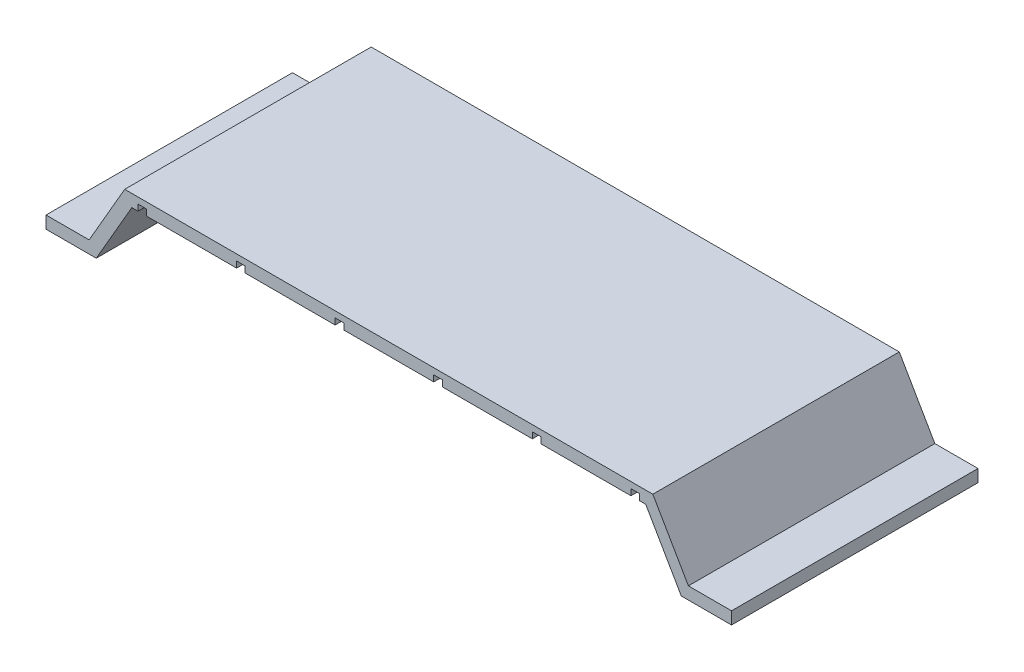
from build123d import *

# Parameters (mm, degrees)
BOSS_EXTRUDE1_DEPTH = 25.4


with BuildPart() as part:
    # Sketch1 → Boss-Extrude1 (new, symmetric)
    with BuildSketch(Plane.XY):
        Polygon((9.271, 0), (-9.271, 0), (-9.271, 1.27), (-11.049, 1.27), (-11.049, 0), (-29.591, 0), (-29.591, 1.27), (-31.369, 1.27), (-31.369, 0), (-49.911, 0), (-49.911, 1.27), (-51.689, 1.27), (-51.689, 0), (-52.959, 0), (-60.291348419, -12.7), (-70.647818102, -12.7), (-70.647818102, -10.16), (-61.757818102, -10.16), (-54.425469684, 2.54), (54.425469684, 2.54), (61.757818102, -10.16), (70.647818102, -10.16), (70.647818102, -12.7), (60.291348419, -12.7), (52.959, 0), (51.689, 0), (51.689, 1.27), (49.911, 1.27), (49.911, 0), (31.369, 0), (31.369, 1.27), (29.591, 1.27), (29.591, 0), (11.049, 0), (11.049, 1.27), (9.271, 1.27), align=None)
    extrude(amount=BOSS_EXTRUDE1_DEPTH, both=True)


solid = part.part
